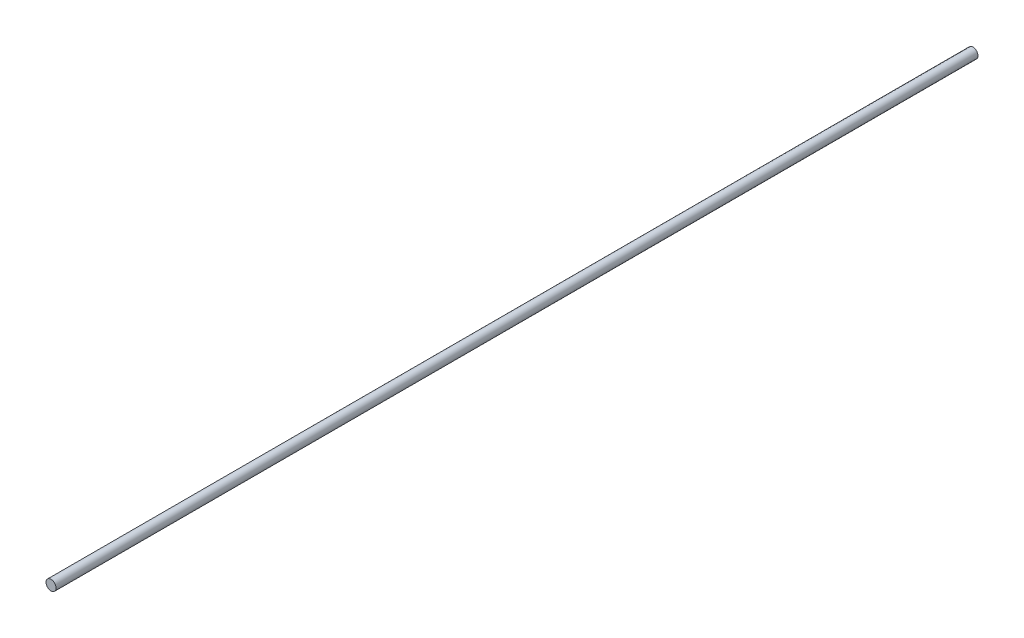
ISO-10303-21;
HEADER;
FILE_DESCRIPTION(('STEP AP214'),'2;1');
FILE_NAME('part.step','',(''),(''),'','','');
FILE_SCHEMA(('AUTOMOTIVE_DESIGN { 1 0 10303 214 1 1 1 1 }'));
ENDSEC;
DATA;
#1=APPLICATION_CONTEXT('core data for automotive mechanical design processes');
#2=APPLICATION_PROTOCOL_DEFINITION('international standard','automotive_design',2000,#1);
#3=PRODUCT_CONTEXT('',#1,'mechanical');
#4=PRODUCT('Part','Part','',(#3));
#5=PRODUCT_RELATED_PRODUCT_CATEGORY('part','',(#4));
#6=PRODUCT_DEFINITION_FORMATION('','',#4);
#7=PRODUCT_DEFINITION_CONTEXT('part definition',#1,'design');
#8=PRODUCT_DEFINITION('design','',#6,#7);
#9=PRODUCT_DEFINITION_SHAPE('','',#8);
#10=(LENGTH_UNIT() NAMED_UNIT(*) SI_UNIT(.MILLI.,.METRE.));
#11=(NAMED_UNIT(*) PLANE_ANGLE_UNIT() SI_UNIT($,.RADIAN.));
#12=(NAMED_UNIT(*) SI_UNIT($,.STERADIAN.) SOLID_ANGLE_UNIT());
#13=UNCERTAINTY_MEASURE_WITH_UNIT(LENGTH_MEASURE(1.E-05),#10,'distance_accuracy_value','');
#14=(GEOMETRIC_REPRESENTATION_CONTEXT(3) GLOBAL_UNCERTAINTY_ASSIGNED_CONTEXT((#13)) GLOBAL_UNIT_ASSIGNED_CONTEXT((#10,
#11,#12)) REPRESENTATION_CONTEXT('',''));
#15=CARTESIAN_POINT('',(0.,0.,0.));
#16=DIRECTION('',(0.,0.,1.));
#17=DIRECTION('',(1.,0.,0.));
#18=AXIS2_PLACEMENT_3D('',#15,#16,#17);
#19=CARTESIAN_POINT('',(0.,0.,-5500.));
#20=DIRECTION('',(0.,0.,1.));
#21=DIRECTION('',(1.,0.,0.));
#22=AXIS2_PLACEMENT_3D('',#19,#20,#21);
#23=CYLINDRICAL_SURFACE('',#22,30.);
#24=CARTESIAN_POINT('',(0.,0.,-5500.));
#25=DIRECTION('',(0.,0.,1.));
#26=DIRECTION('',(1.,0.,0.));
#27=AXIS2_PLACEMENT_3D('',#24,#25,#26);
#28=CIRCLE('',#27,30.);
#29=CARTESIAN_POINT('',(30.,0.,-5500.));
#30=VERTEX_POINT('',#29);
#31=EDGE_CURVE('E10',#30,#30,#28,.T.);
#32=ORIENTED_EDGE('',*,*,#31,.T.);
#33=EDGE_LOOP('',(#32));
#34=FACE_BOUND('',#33,.T.);
#35=CARTESIAN_POINT('',(0.,0.,0.));
#36=DIRECTION('',(0.,0.,1.));
#37=DIRECTION('',(1.,0.,0.));
#38=AXIS2_PLACEMENT_3D('',#35,#36,#37);
#39=CIRCLE('',#38,30.);
#40=CARTESIAN_POINT('',(30.,0.,0.));
#41=VERTEX_POINT('',#40);
#42=EDGE_CURVE('E40',#41,#41,#39,.T.);
#43=ORIENTED_EDGE('',*,*,#42,.F.);
#44=EDGE_LOOP('',(#43));
#45=FACE_BOUND('',#44,.T.);
#46=ADVANCED_FACE('F37',(#34,#45),#23,.T.);
#47=CARTESIAN_POINT('',(0.,0.,-5500.));
#48=DIRECTION('',(0.,0.,1.));
#49=DIRECTION('',(1.,0.,0.));
#50=AXIS2_PLACEMENT_3D('',#47,#48,#49);
#51=PLANE('',#50);
#52=ORIENTED_EDGE('',*,*,#31,.F.);
#53=EDGE_LOOP('',(#52));
#54=FACE_BOUND('',#53,.T.);
#55=ADVANCED_FACE('F54',(#54),#51,.F.);
#56=CARTESIAN_POINT('',(0.,0.,0.));
#57=DIRECTION('',(0.,0.,1.));
#58=DIRECTION('',(1.,0.,0.));
#59=AXIS2_PLACEMENT_3D('',#56,#57,#58);
#60=PLANE('',#59);
#61=ORIENTED_EDGE('',*,*,#42,.T.);
#62=EDGE_LOOP('',(#61));
#63=FACE_BOUND('',#62,.T.);
#64=ADVANCED_FACE('F51',(#63),#60,.T.);
#65=CLOSED_SHELL('',(#46,#55,#64));
#66=MANIFOLD_SOLID_BREP('B2',#65);
#67=ADVANCED_BREP_SHAPE_REPRESENTATION('',(#18,#66),#14);
#68=SHAPE_DEFINITION_REPRESENTATION(#9,#67);
ENDSEC;
END-ISO-10303-21;
